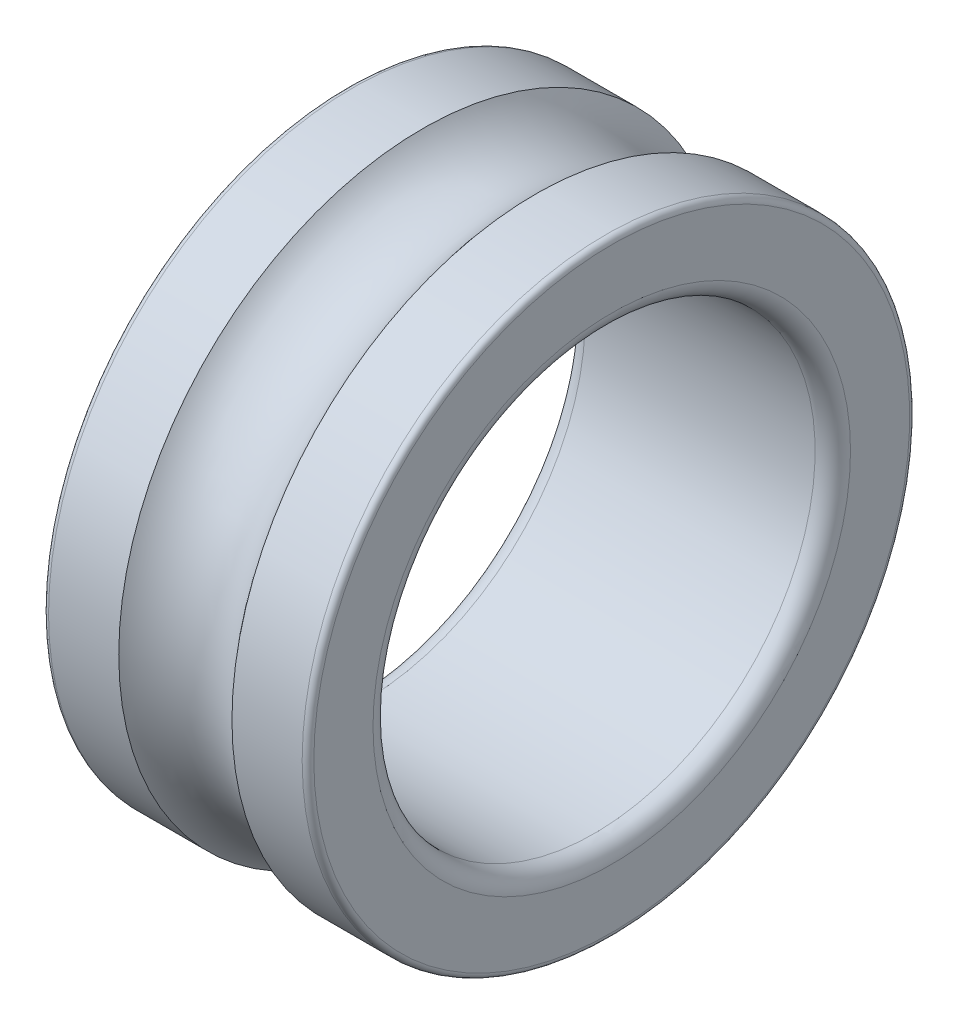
ISO-10303-21;
HEADER;
FILE_DESCRIPTION(('STEP AP214'),'2;1');
FILE_NAME('part.step','',(''),(''),'','','');
FILE_SCHEMA(('AUTOMOTIVE_DESIGN { 1 0 10303 214 1 1 1 1 }'));
ENDSEC;
DATA;
#1=APPLICATION_CONTEXT('core data for automotive mechanical design processes');
#2=APPLICATION_PROTOCOL_DEFINITION('international standard','automotive_design',2000,#1);
#3=PRODUCT_CONTEXT('',#1,'mechanical');
#4=PRODUCT('Part','Part','',(#3));
#5=PRODUCT_RELATED_PRODUCT_CATEGORY('part','',(#4));
#6=PRODUCT_DEFINITION_FORMATION('','',#4);
#7=PRODUCT_DEFINITION_CONTEXT('part definition',#1,'design');
#8=PRODUCT_DEFINITION('design','',#6,#7);
#9=PRODUCT_DEFINITION_SHAPE('','',#8);
#10=(LENGTH_UNIT() NAMED_UNIT(*) SI_UNIT(.MILLI.,.METRE.));
#11=(NAMED_UNIT(*) PLANE_ANGLE_UNIT() SI_UNIT($,.RADIAN.));
#12=(NAMED_UNIT(*) SI_UNIT($,.STERADIAN.) SOLID_ANGLE_UNIT());
#13=UNCERTAINTY_MEASURE_WITH_UNIT(LENGTH_MEASURE(1.E-05),#10,'distance_accuracy_value','');
#14=(GEOMETRIC_REPRESENTATION_CONTEXT(3) GLOBAL_UNCERTAINTY_ASSIGNED_CONTEXT((#13)) GLOBAL_UNIT_ASSIGNED_CONTEXT((#10,
#11,#12)) REPRESENTATION_CONTEXT('',''));
#15=CARTESIAN_POINT('',(0.,0.,0.));
#16=DIRECTION('',(0.,0.,1.));
#17=DIRECTION('',(1.,0.,0.));
#18=AXIS2_PLACEMENT_3D('',#15,#16,#17);
#19=CARTESIAN_POINT('',(1.,0.,0.));
#20=DIRECTION('',(-1.,0.,0.));
#21=DIRECTION('',(0.,0.,1.));
#22=AXIS2_PLACEMENT_3D('',#19,#20,#21);
#23=TOROIDAL_SURFACE('',#22,13.5,1.);
#24=CARTESIAN_POINT('',(1.00000000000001,0.,0.));
#25=DIRECTION('',(-1.,0.,0.));
#26=DIRECTION('',(0.,0.,1.));
#27=AXIS2_PLACEMENT_3D('',#24,#25,#26);
#28=CIRCLE('',#27,12.5);
#29=CARTESIAN_POINT('',(1.00000000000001,0.,12.5));
#30=VERTEX_POINT('',#29);
#31=EDGE_CURVE('E68',#30,#30,#28,.T.);
#32=ORIENTED_EDGE('',*,*,#31,.F.);
#33=EDGE_LOOP('',(#32));
#34=FACE_BOUND('',#33,.T.);
#35=CARTESIAN_POINT('',(0.,0.,0.));
#36=DIRECTION('',(-1.,0.,0.));
#37=DIRECTION('',(0.,0.,1.));
#38=AXIS2_PLACEMENT_3D('',#35,#36,#37);
#39=CIRCLE('',#38,13.5);
#40=CARTESIAN_POINT('',(0.,0.,13.5));
#41=VERTEX_POINT('',#40);
#42=EDGE_CURVE('E10',#41,#41,#39,.T.);
#43=ORIENTED_EDGE('',*,*,#42,.T.);
#44=EDGE_LOOP('',(#43));
#45=FACE_BOUND('',#44,.T.);
#46=ADVANCED_FACE('F34',(#34,#45),#23,.T.);
#47=CARTESIAN_POINT('',(0.,16.845,0.));
#48=DIRECTION('',(1.,0.,0.));
#49=DIRECTION('',(0.,0.,-1.));
#50=AXIS2_PLACEMENT_3D('',#47,#48,#49);
#51=PLANE('',#50);
#52=ORIENTED_EDGE('',*,*,#42,.F.);
#53=EDGE_LOOP('',(#52));
#54=FACE_BOUND('',#53,.T.);
#55=CARTESIAN_POINT('',(0.,0.,0.));
#56=DIRECTION('',(-1.,0.,0.));
#57=DIRECTION('',(0.,0.,1.));
#58=AXIS2_PLACEMENT_3D('',#55,#56,#57);
#59=CIRCLE('',#58,16.845);
#60=CARTESIAN_POINT('',(0.,0.,16.845));
#61=VERTEX_POINT('',#60);
#62=EDGE_CURVE('E40',#61,#61,#59,.T.);
#63=ORIENTED_EDGE('',*,*,#62,.T.);
#64=EDGE_LOOP('',(#63));
#65=FACE_BOUND('',#64,.T.);
#66=ADVANCED_FACE('F75',(#54,#65),#51,.F.);
#67=CARTESIAN_POINT('',(0.330000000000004,0.,0.));
#68=DIRECTION('',(-1.,0.,0.));
#69=DIRECTION('',(0.,0.,1.));
#70=AXIS2_PLACEMENT_3D('',#67,#68,#69);
#71=TOROIDAL_SURFACE('',#70,16.845,0.33);
#72=ORIENTED_EDGE('',*,*,#62,.F.);
#73=EDGE_LOOP('',(#72));
#74=FACE_BOUND('',#73,.T.);
#75=CARTESIAN_POINT('',(0.330000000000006,0.,0.));
#76=DIRECTION('',(-1.,0.,0.));
#77=DIRECTION('',(0.,0.,1.));
#78=AXIS2_PLACEMENT_3D('',#75,#76,#77);
#79=CIRCLE('',#78,17.175);
#80=CARTESIAN_POINT('',(0.330000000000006,0.,17.175));
#81=VERTEX_POINT('',#80);
#82=EDGE_CURVE('E44',#81,#81,#79,.T.);
#83=ORIENTED_EDGE('',*,*,#82,.T.);
#84=EDGE_LOOP('',(#83));
#85=FACE_BOUND('',#84,.T.);
#86=ADVANCED_FACE('F79',(#74,#85),#71,.T.);
#87=CARTESIAN_POINT('',(0.,0.,0.));
#88=DIRECTION('',(-1.,0.,0.));
#89=DIRECTION('',(0.,0.,1.));
#90=AXIS2_PLACEMENT_3D('',#87,#88,#89);
#91=CYLINDRICAL_SURFACE('',#90,17.175);
#92=ORIENTED_EDGE('',*,*,#82,.F.);
#93=EDGE_LOOP('',(#92));
#94=FACE_BOUND('',#93,.T.);
#95=CARTESIAN_POINT('',(4.3,0.,0.));
#96=DIRECTION('',(-1.,0.,0.));
#97=DIRECTION('',(0.,0.,1.));
#98=AXIS2_PLACEMENT_3D('',#95,#96,#97);
#99=CIRCLE('',#98,17.175);
#100=CARTESIAN_POINT('',(4.3,0.,17.175));
#101=VERTEX_POINT('',#100);
#102=EDGE_CURVE('E48',#101,#101,#99,.T.);
#103=ORIENTED_EDGE('',*,*,#102,.T.);
#104=EDGE_LOOP('',(#103));
#105=FACE_BOUND('',#104,.T.);
#106=ADVANCED_FACE('F84',(#94,#105),#91,.T.);
#107=CARTESIAN_POINT('',(7.50000000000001,0.,0.));
#108=DIRECTION('',(-1.,0.,0.));
#109=DIRECTION('',(0.,0.,1.));
#110=AXIS2_PLACEMENT_3D('',#107,#108,#109);
#111=TOROIDAL_SURFACE('',#110,19.5229695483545,3.969);
#112=ORIENTED_EDGE('',*,*,#102,.F.);
#113=EDGE_LOOP('',(#112));
#114=FACE_BOUND('',#113,.T.);
#115=CARTESIAN_POINT('',(10.7,0.,0.));
#116=DIRECTION('',(-1.,0.,0.));
#117=DIRECTION('',(0.,0.,1.));
#118=AXIS2_PLACEMENT_3D('',#115,#116,#117);
#119=CIRCLE('',#118,17.175);
#120=CARTESIAN_POINT('',(10.7,0.,17.175));
#121=VERTEX_POINT('',#120);
#122=EDGE_CURVE('E53',#121,#121,#119,.T.);
#123=ORIENTED_EDGE('',*,*,#122,.T.);
#124=EDGE_LOOP('',(#123));
#125=FACE_BOUND('',#124,.T.);
#126=ADVANCED_FACE('F90',(#114,#125),#111,.F.);
#127=CARTESIAN_POINT('',(0.,0.,0.));
#128=DIRECTION('',(-1.,0.,0.));
#129=DIRECTION('',(0.,0.,1.));
#130=AXIS2_PLACEMENT_3D('',#127,#128,#129);
#131=CYLINDRICAL_SURFACE('',#130,17.175);
#132=ORIENTED_EDGE('',*,*,#122,.F.);
#133=EDGE_LOOP('',(#132));
#134=FACE_BOUND('',#133,.T.);
#135=CARTESIAN_POINT('',(14.67,0.,0.));
#136=DIRECTION('',(-1.,0.,0.));
#137=DIRECTION('',(0.,0.,1.));
#138=AXIS2_PLACEMENT_3D('',#135,#136,#137);
#139=CIRCLE('',#138,17.175);
#140=CARTESIAN_POINT('',(14.67,0.,17.175));
#141=VERTEX_POINT('',#140);
#142=EDGE_CURVE('E56',#141,#141,#139,.T.);
#143=ORIENTED_EDGE('',*,*,#142,.T.);
#144=EDGE_LOOP('',(#143));
#145=FACE_BOUND('',#144,.T.);
#146=ADVANCED_FACE('F94',(#134,#145),#131,.T.);
#147=CARTESIAN_POINT('',(14.67,0.,0.));
#148=DIRECTION('',(-1.,0.,0.));
#149=DIRECTION('',(0.,0.,1.));
#150=AXIS2_PLACEMENT_3D('',#147,#148,#149);
#151=TOROIDAL_SURFACE('',#150,16.845,0.33);
#152=ORIENTED_EDGE('',*,*,#142,.F.);
#153=EDGE_LOOP('',(#152));
#154=FACE_BOUND('',#153,.T.);
#155=CARTESIAN_POINT('',(15.,0.,0.));
#156=DIRECTION('',(-1.,0.,0.));
#157=DIRECTION('',(0.,0.,1.));
#158=AXIS2_PLACEMENT_3D('',#155,#156,#157);
#159=CIRCLE('',#158,16.845);
#160=CARTESIAN_POINT('',(15.,0.,16.845));
#161=VERTEX_POINT('',#160);
#162=EDGE_CURVE('E59',#161,#161,#159,.T.);
#163=ORIENTED_EDGE('',*,*,#162,.T.);
#164=EDGE_LOOP('',(#163));
#165=FACE_BOUND('',#164,.T.);
#166=ADVANCED_FACE('F98',(#154,#165),#151,.T.);
#167=CARTESIAN_POINT('',(15.,13.5,0.));
#168=DIRECTION('',(-1.,0.,0.));
#169=DIRECTION('',(0.,0.,1.));
#170=AXIS2_PLACEMENT_3D('',#167,#168,#169);
#171=PLANE('',#170);
#172=ORIENTED_EDGE('',*,*,#162,.F.);
#173=EDGE_LOOP('',(#172));
#174=FACE_BOUND('',#173,.T.);
#175=CARTESIAN_POINT('',(15.,0.,0.));
#176=DIRECTION('',(-1.,0.,0.));
#177=DIRECTION('',(0.,0.,1.));
#178=AXIS2_PLACEMENT_3D('',#175,#176,#177);
#179=CIRCLE('',#178,13.5);
#180=CARTESIAN_POINT('',(15.,0.,13.5));
#181=VERTEX_POINT('',#180);
#182=EDGE_CURVE('E62',#181,#181,#179,.T.);
#183=ORIENTED_EDGE('',*,*,#182,.T.);
#184=EDGE_LOOP('',(#183));
#185=FACE_BOUND('',#184,.T.);
#186=ADVANCED_FACE('F102',(#174,#185),#171,.F.);
#187=CARTESIAN_POINT('',(14.,0.,0.));
#188=DIRECTION('',(-1.,0.,0.));
#189=DIRECTION('',(0.,0.,1.));
#190=AXIS2_PLACEMENT_3D('',#187,#188,#189);
#191=TOROIDAL_SURFACE('',#190,13.5,1.);
#192=ORIENTED_EDGE('',*,*,#182,.F.);
#193=EDGE_LOOP('',(#192));
#194=FACE_BOUND('',#193,.T.);
#195=CARTESIAN_POINT('',(14.,0.,0.));
#196=DIRECTION('',(-1.,0.,0.));
#197=DIRECTION('',(0.,0.,1.));
#198=AXIS2_PLACEMENT_3D('',#195,#196,#197);
#199=CIRCLE('',#198,12.5);
#200=CARTESIAN_POINT('',(14.,0.,12.5));
#201=VERTEX_POINT('',#200);
#202=EDGE_CURVE('E65',#201,#201,#199,.T.);
#203=ORIENTED_EDGE('',*,*,#202,.T.);
#204=EDGE_LOOP('',(#203));
#205=FACE_BOUND('',#204,.T.);
#206=ADVANCED_FACE('F106',(#194,#205),#191,.T.);
#207=CARTESIAN_POINT('',(0.,0.,0.));
#208=DIRECTION('',(-1.,0.,0.));
#209=DIRECTION('',(0.,0.,1.));
#210=AXIS2_PLACEMENT_3D('',#207,#208,#209);
#211=CYLINDRICAL_SURFACE('',#210,12.5);
#212=ORIENTED_EDGE('',*,*,#202,.F.);
#213=EDGE_LOOP('',(#212));
#214=FACE_BOUND('',#213,.T.);
#215=ORIENTED_EDGE('',*,*,#31,.T.);
#216=EDGE_LOOP('',(#215));
#217=FACE_BOUND('',#216,.T.);
#218=ADVANCED_FACE('F72',(#214,#217),#211,.F.);
#219=CLOSED_SHELL('',(#46,#66,#86,#106,#126,#146,#166,#186,#206,#218));
#220=MANIFOLD_SOLID_BREP('B2',#219);
#221=ADVANCED_BREP_SHAPE_REPRESENTATION('',(#18,#220),#14);
#222=SHAPE_DEFINITION_REPRESENTATION(#9,#221);
ENDSEC;
END-ISO-10303-21;
